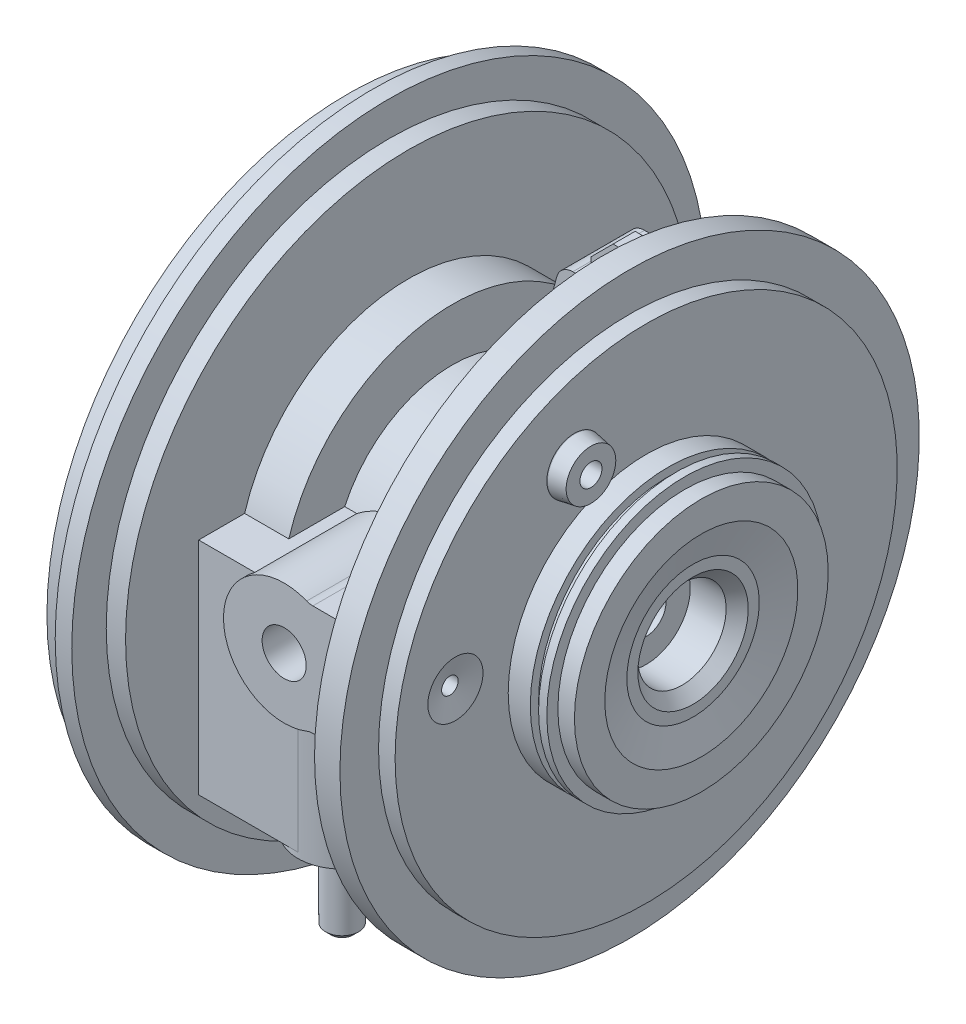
from build123d import *

# Parameters (mm, degrees)
CONG_2_R                     = 0.5
EXTRUSION1_DEPTH             = 40
ESQUISSE2_R                  = 2.5
ENL_V_MAT_EXTRU_1_DEPTH      = 98.947230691
ESQUISSE3_R                  = 3.6
ENL_V_MAT_EXTRU_2_DEPTH      = 25
EXTRUSION2_START             = 1
EXTRUSION2_DEPTH             = 1
EXTRUSION3_DEPTH             = 13
EXTRUSION4_REACH             = 131.334
ESQUISSE8_R                  = 6.5
ESQUISSE8_R_2                = 2.5
ENL_V_MAT_EXTRU_3_DEPTH      = 12
ESQUISSE9_R                  = 4
ENL_V_MAT_EXTRU_4_DEPTH      = 12
ESQUISSE10_R                 = 3
EXTRUSION5_DEPTH             = 15
CHANFREIN1_SIZE              = 1
ESQUISSE11_R                 = 4
ENL_V_MAT_EXTRU_5_DEPTH      = 34
ESQUISSE12_R                 = 5
EXTRUSION6_DEPTH             = 4
EXTRUSION7_START             = 3
ESQUISSE14_R                 = 5
EXTRUSION7_DEPTH             = 3
CHANFREIN2_SIZE              = 2.9
CHANFREIN2_SIZE2             = 0.5
ESQUISSE13_R                 = 2
ENL_V_MAT_EXTRU_6_DEPTH      = 91.844647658
EXTRUSION8_DEPTH             = 8
ENL_V_MAT_EXTRU_7_DEPTH      = 20
ENL_V_MAT_EXTRU_7_DEPTH_BACK = 4
ENL_V_MAT_EXTRU_8_REACH      = 114.567
ESQUISSE17_R                 = 2
ESQUISSE18_R                 = 1.5
ENL_V_MAT_EXTRU_9_DEPTH      = 9
CHANFREIN3_SIZE              = 3.5
CHANFREIN3_SIZE2             = 1


with BuildPart() as part:
    # Esquisse1 → R_volution1 (revolve)
    with BuildSketch(Plane.XY, mode=Mode.PRIVATE) as r_volution1_sk:
        with BuildLine():
            Line((-54.6, 0), (-10, 0))
            Line((-10, 0), (-10, 8))
            Line((-10, 8), (-3.5, 8))
            Line((-3.5, 8), (-1.5, 10))
            Line((-1.5, 10), (-1.5, 12))
            Line((-1.5, 12), (0, 17.5))
            Line((0, 17.5), (0, 23))
            Line((0, 23), (-3, 23))
            Line((-3, 23), (-3, 25))
            Line((-3, 25), (-4.5, 25))
            Line((-4.5, 25), (-4.5, 23.5))
            Line((-4.5, 23.5), (-6, 23.5))
            Line((-6, 23.5), (-6, 25))
            Line((-6, 25), (-10, 25))
            Line((-10, 25), (-10, 45.5))
            Line((-10, 45.5), (-13, 45.5))
            Line((-13, 45.5), (-13, 52.5))
            Line((-13, 52.5), (-17.6, 52.5))
            Line((-17.6, 52.5), (-17.6, 46.5))
            Line((-17.6, 46.5), (-19.6, 46.5))
            Line((-19.6, 46.5), (-19.6, 21.5))
            Line((-19.6, 21.5), (-45.1, 21.5))
            Line((-45.1, 21.5), (-45.1, 31))
            Line((-45.1, 31), (-53.1, 31))
            Line((-53.1, 31), (-53.1, 51.25))
            Line((-53.1, 51.25), (-56.6, 51.25))
            Line((-56.6, 51.25), (-56.6, 57.5))
            Line((-56.6, 57.5), (-59.6, 57.5))
            Line((-59.6, 57.5), (-59.6, 54.5))
            Line((-59.6, 54.5), (-64.1, 54.5))
            Line((-64.1, 54.5), (-64.1, 53.5))
            ThreePointArc((-64.1, 53.5), (-60.439745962, 49.839745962), (-59.1, 44.839745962))
            Line((-59.1, 44.839745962), (-59.1, 24))
            Line((-59.1, 24), (-58.1, 24))
            Line((-58.1, 24), (-58.1, 21))
            ThreePointArc((-58.1, 21), (-56.95482419, 12.448684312), (-53.6, 4.5))
            Line((-53.6, 4.5), (-54.6, 4.5))
            Line((-54.6, 4.5), (-54.6, 0))
        make_face()
    revolve(r_volution1_sk.sketch.rotate(Axis((-54.6, 0, 0), (1, 0, 0)), 90), axis=Axis((-54.6, 0, 0), (1, 0, 0)))

    # Cong_2
    cong_2_edges = [part.edges().sort_by_distance(p)[0] for p in [
        (-59.1, 0, -24),
        (-64.1, 0, -53.5),
    ]]
    fillet(cong_2_edges, radius=CONG_2_R)

    # Esquisse4 → Extrusion1 (add)
    with BuildSketch(Plane(origin=(0, -31, 0), x_dir=(-1, 0, 0), z_dir=(0, 1, 0))):
        with BuildLine():
            Line((53.1, 38), (35.1, 38))
            ThreePointArc((35.1, 38), (31.594156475, 37.190901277), (28.797456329, 34.927265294))
            Line((28.797456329, 34.927265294), (22.6, 27))
            Line((22.6, 27), (19.6, 27))
            Line((19.6, 27), (19.6, -18))
            Line((19.6, -18), (22.6, -18))
            Line((22.6, -18), (28.797456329, -25.927265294))
            ThreePointArc((28.797456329, -25.927265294), (31.594156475, -28.190901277), (35.1, -29))
            Line((35.1, -29), (53.1, -29))
            Line((53.1, -29), (53.1, 38))
        make_face()
    extrude(amount=EXTRUSION1_DEPTH)

    # Esquisse2 → Enl_v. mat.-Extru.1 (cut, through all)
    with BuildSketch(Plane.ZY.offset(54.6)):
        Circle(ESQUISSE2_R)
    extrude(amount=-ENL_V_MAT_EXTRU_1_DEPTH, mode=Mode.SUBTRACT)

    # Esquisse3 → Enl_v. mat.-Extru.2 (cut)
    with BuildSketch(Plane(origin=(0, 0, 0), x_dir=(0, 0, -1), z_dir=(1, 0, 0))):
        Circle(ESQUISSE3_R)
    extrude(amount=-ENL_V_MAT_EXTRU_2_DEPTH, mode=Mode.SUBTRACT)

    # Esquisse5 → Extrusion2 (add)
    with BuildSketch(Plane.XZ.offset(31).offset(EXTRUSION2_START)):
        with BuildLine():
            Line((-46.66307787, 24.13251215), (-42.350462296, 33.380946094))
            ThreePointArc((-42.350462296, 33.380946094), (-35.1, 38), (-27.849537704, 33.380946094))
            Line((-27.849537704, 33.380946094), (-23.53692213, 24.13251215))
            ThreePointArc((-23.53692213, 24.13251215), (-22.837039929, 22.070725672), (-22.6, 19.906329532))
            Line((-22.6, 19.906329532), (-22.6, -10.906329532))
            ThreePointArc((-22.6, -10.906329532), (-22.837039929, -13.070725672), (-23.53692213, -15.13251215))
            Line((-23.53692213, -15.13251215), (-27.849537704, -24.380946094))
            ThreePointArc((-27.849537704, -24.380946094), (-35.1, -29), (-42.350462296, -24.380946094))
            Line((-42.350462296, -24.380946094), (-46.66307787, -15.13251215))
            ThreePointArc((-46.66307787, -15.13251215), (-47.362960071, -13.070725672), (-47.6, -10.906329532))
            Line((-47.6, -10.906329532), (-47.6, 19.906329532))
            ThreePointArc((-47.6, 19.906329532), (-47.362960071, 22.070725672), (-46.66307787, 24.13251215))
        make_face()
    extrude(amount=-EXTRUSION2_DEPTH)

    # Esquisse6 → Extrusion3 (add)
    with BuildSketch(Plane.XY.offset(-31)):
        with BuildLine():
            Line((-19.6, -17), (-19.6, 17))
            Line((-19.6, 17), (-21.082628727, 17))
            ThreePointArc((-21.082628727, 17), (-22.908913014, 17.619939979), (-23.980406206, 19.223542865))
            Line((-23.980406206, 19.223542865), (-26.004203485, 26.776457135))
            ThreePointArc((-26.004203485, 26.776457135), (-27.075696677, 28.380060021), (-28.901980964, 29))
            Line((-28.901980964, 29), (-41.298019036, 29))
            ThreePointArc((-41.298019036, 29), (-43.124303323, 28.380060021), (-44.195796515, 26.776457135))
            Line((-44.195796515, 26.776457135), (-48.095238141, 12.223542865))
            ThreePointArc((-48.095238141, 12.223542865), (-49.166731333, 10.619939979), (-50.99301562, 10))
            Line((-50.99301562, 10), (-53.1, 10))
            Line((-53.1, 10), (-53.1, -10))
            Line((-53.1, -10), (-50.99301562, -10))
            ThreePointArc((-50.99301562, -10), (-49.166731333, -10.619939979), (-48.095238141, -12.223542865))
            Line((-48.095238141, -12.223542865), (-44.195796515, -26.776457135))
            ThreePointArc((-44.195796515, -26.776457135), (-43.124303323, -28.380060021), (-41.298019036, -29))
            Line((-41.298019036, -29), (-28.901980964, -29))
            ThreePointArc((-28.901980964, -29), (-27.075696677, -28.380060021), (-26.004203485, -26.776457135))
            Line((-26.004203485, -26.776457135), (-23.980406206, -19.223542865))
            ThreePointArc((-23.980406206, -19.223542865), (-22.908913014, -17.619939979), (-21.082628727, -17))
            Line((-21.082628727, -17), (-19.6, -17))
        make_face()
    extrude(amount=EXTRUSION3_DEPTH)

    # Esquisse7 → Extrusion4 (add, up to next)
    with BuildSketch(Plane(origin=(0, 0, 39), x_dir=(-1, 0, 0), z_dir=(0, 0, -1)), mode=Mode.PRIVATE) as extrusion4_sk1:
        with BuildLine():
            Line((19.6, 10), (31.403847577, 10))
            ThreePointArc((31.403847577, 10), (31.970794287, 10.054058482), (32.517308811, 10.214285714))
            ThreePointArc((32.517308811, 10.214285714), (47.6, 0), (32.517308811, -10.214285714))
            ThreePointArc((32.517308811, -10.214285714), (31.970794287, -10.054058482), (31.403847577, -10))
            Line((31.403847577, -10), (19.6, -10))
            Line((19.6, -10), (19.6, 10))
        make_face()
    extrusion4_tool1 = extrude(extrusion4_sk1.sketch, amount=EXTRUSION4_REACH, mode=Mode.PRIVATE) - part.part
    add(extrusion4_tool1.solids().sort_by_distance((-32.845347, 0, 39))[0])

    # Esquisse8 → Enl_v. mat.-Extru.3 (cut)
    with BuildSketch(Plane(origin=(0, 0, -31), x_dir=(-1, 0, 0), z_dir=(0, 0, -1))):
        with Locations((35.1, 0)):
            Circle(ESQUISSE8_R)
        with Locations((35.1, 20)):
            Circle(ESQUISSE8_R_2)
        with Locations((35.1, -20)):
            Circle(ESQUISSE8_R_2)
    extrude(amount=-ENL_V_MAT_EXTRU_3_DEPTH, mode=Mode.SUBTRACT)

    # Esquisse9 → Enl_v. mat.-Extru.4 (cut)
    with BuildSketch(Plane.XZ.offset(32)):
        with Locations(Location((-35.1, 16.5, 0), (0, 0, 270))):
            Circle(ESQUISSE9_R)
        with Locations(Location((-35.1, -7.5, 0), (0, 0, 270))):
            Circle(ESQUISSE9_R)
    extrude(amount=-ENL_V_MAT_EXTRU_4_DEPTH, mode=Mode.SUBTRACT)

    # Esquisse10 → Extrusion5 (add)
    with BuildSketch(Plane.XZ.offset(32)):
        with Locations(Location((-35.1, 30, 0), (0, 0, 90))):
            Circle(ESQUISSE10_R)
        with Locations(Location((-35.1, -21, 0), (0, 0, 90))):
            Circle(ESQUISSE10_R)
    extrude(amount=EXTRUSION5_DEPTH)

    # Chanfrein1
    chanfrein1_edges = [part.edges().sort_by_distance(p)[0] for p in [
        (-35.1, -47, 27),
        (-35.1, -47, -24),
    ]]
    chamfer(chanfrein1_edges, length=CHANFREIN1_SIZE)

    # Esquisse11 → Enl_v. mat.-Extru.5 (cut)
    with BuildSketch(Plane.XY.offset(39)):
        with Locations((-36.6, 0)):
            Circle(ESQUISSE11_R)
    extrude(amount=-ENL_V_MAT_EXTRU_5_DEPTH, mode=Mode.SUBTRACT)

    # Esquisse12 → Extrusion6 (add)
    with BuildSketch(Plane.ZY.offset(19.6)):
        with Locations(Location((13, 29.786742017, 0), (0, 0, 180))):
            Circle(ESQUISSE12_R)
    extrude(amount=EXTRUSION6_DEPTH)

    # Esquisse14 → Extrusion7 (add)
    with BuildSketch(Plane(origin=(-10, 0, 0), x_dir=(0, 0, -1), z_dir=(1, 0, 0)).offset(EXTRUSION7_START)):
        with Locations((-13, 29.786742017)):
            Circle(ESQUISSE14_R)
    extrude(amount=-EXTRUSION7_DEPTH)

    # Chanfrein2
    chanfrein2_edges = [part.edges().sort_by_distance(p)[0] for p in [
        (-7, 29.786742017, 18),
    ]]
    chanfrein2_side = [part.faces().sort_by_distance(p)[0] for p in [
        (-8.5, 29.786742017, 18),
    ]]
    chamfer(chanfrein2_edges, length=CHANFREIN2_SIZE, length2=CHANFREIN2_SIZE2, reference=chanfrein2_side[0])

    # Esquisse13 → Enl_v. mat.-Extru.6 (cut, through all)
    with BuildSketch(Plane.ZY.offset(23.6)):
        with Locations((13, 29.786742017)):
            Circle(ESQUISSE13_R)
    extrude(amount=-ENL_V_MAT_EXTRU_6_DEPTH, mode=Mode.SUBTRACT)

    # Esquisse15 → Extrusion8 (add)
    with BuildSketch(Plane(origin=(0, 0, -19), x_dir=(-1, 0, 0), z_dir=(0, 0, -1))):
        Polygon((19.6, 44), (27, 44), (31, 40), (31, 9), (19.6, 9), align=None)
    extrude(amount=-EXTRUSION8_DEPTH)

    # Esquisse16 → Enl_v. mat.-Extru.7 (cut, two sides: drawn at the far end of the back side and taken through both)
    with BuildSketch(Plane(origin=(0, 0, -19), x_dir=(-1, 0, 0), z_dir=(0, 0, -1)).offset(-ENL_V_MAT_EXTRU_7_DEPTH_BACK)):
        with BuildLine():
            Line((18.1, 54.5), (38.1, 54.5))
            Line((38.1, 54.5), (38.1, 29.5))
            Line((38.1, 29.5), (22.1, 29.5))
            ThreePointArc((22.1, 29.5), (19.271572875, 30.671572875), (18.1, 33.5))
            Line((18.1, 33.5), (18.1, 54.5))
        make_face()
    extrude(amount=ENL_V_MAT_EXTRU_7_DEPTH + ENL_V_MAT_EXTRU_7_DEPTH_BACK, mode=Mode.SUBTRACT)

    # Esquisse17 → Enl_v. mat.-Extru.8 (cut, up to next)
    with BuildSketch(Plane(origin=(0, 0, -15), x_dir=(-1, 0, 0), z_dir=(0, 0, -1)), mode=Mode.PRIVATE) as enl_v_mat_extru_8_sk1:
        with Locations((25, 38)):
            Circle(ESQUISSE17_R)
    enl_v_mat_extru_8_tool1 = extrude(enl_v_mat_extru_8_sk1.sketch, amount=-ENL_V_MAT_EXTRU_8_REACH, mode=Mode.PRIVATE) & part.part
    add(enl_v_mat_extru_8_tool1.solids().sort_by_distance((-25, 38, -15))[0], mode=Mode.SUBTRACT)

    # Esquisse18 → Enl_v. mat.-Extru.9 (cut)
    with BuildSketch(Plane(origin=(-10, 0, 0), x_dir=(0, 0, -1), z_dir=(1, 0, 0))):
        with Locations((-34.569016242, 5.475684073)):
            Circle(ESQUISSE18_R)
    extrude(amount=-ENL_V_MAT_EXTRU_9_DEPTH, mode=Mode.SUBTRACT)

    # Chanfrein3
    chanfrein3_edges = [part.edges().sort_by_distance(p)[0] for p in [
        (-10, 5.475684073, 36.069016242),
    ]]
    chanfrein3_side = [part.faces().sort_by_distance(p)[0] for p in [
        (-10, 0, -44.213065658),
    ]]
    chamfer(chanfrein3_edges, length=CHANFREIN3_SIZE, length2=CHANFREIN3_SIZE2, reference=chanfrein3_side[0])


solid = part.part
